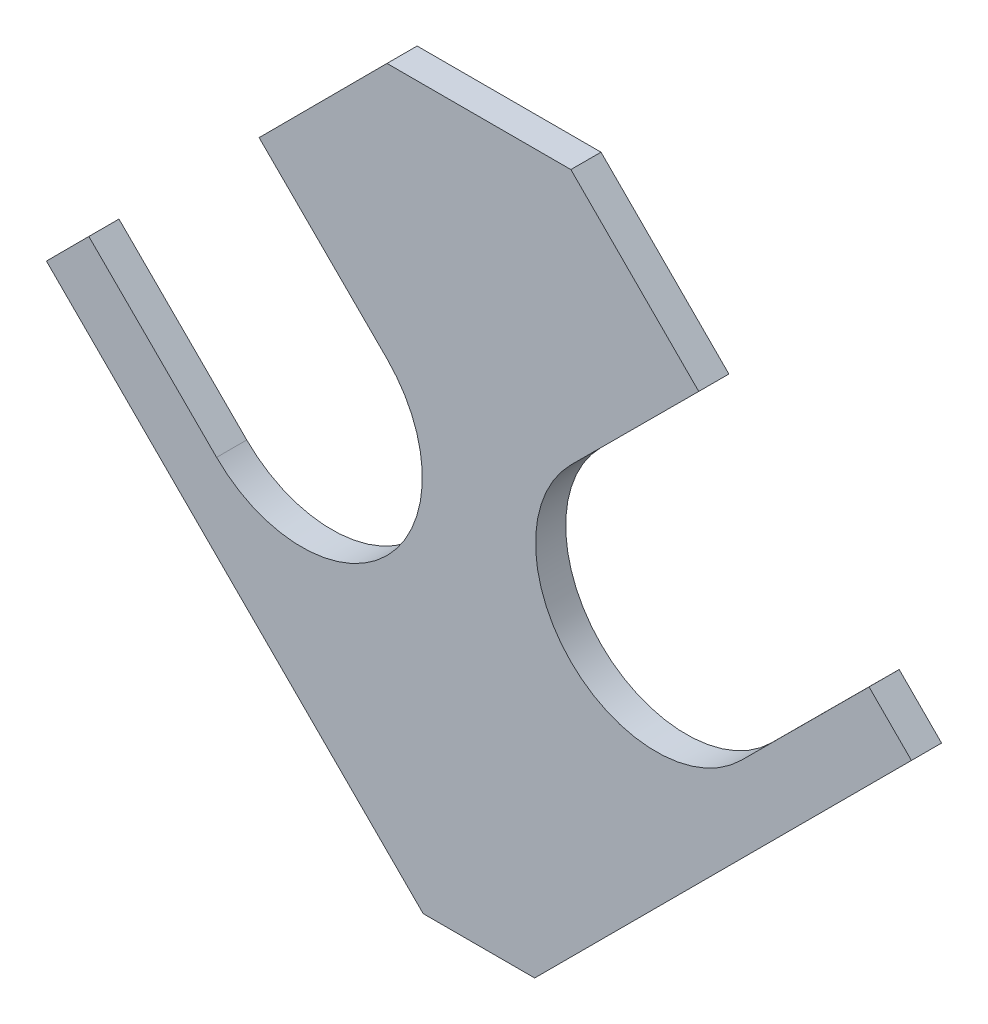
ISO-10303-21;
HEADER;
FILE_DESCRIPTION(('STEP AP214'),'2;1');
FILE_NAME('part.step','',(''),(''),'','','');
FILE_SCHEMA(('AUTOMOTIVE_DESIGN { 1 0 10303 214 1 1 1 1 }'));
ENDSEC;
DATA;
#1=APPLICATION_CONTEXT('core data for automotive mechanical design processes');
#2=APPLICATION_PROTOCOL_DEFINITION('international standard','automotive_design',2000,#1);
#3=PRODUCT_CONTEXT('',#1,'mechanical');
#4=PRODUCT('Part','Part','',(#3));
#5=PRODUCT_RELATED_PRODUCT_CATEGORY('part','',(#4));
#6=PRODUCT_DEFINITION_FORMATION('','',#4);
#7=PRODUCT_DEFINITION_CONTEXT('part definition',#1,'design');
#8=PRODUCT_DEFINITION('design','',#6,#7);
#9=PRODUCT_DEFINITION_SHAPE('','',#8);
#10=(LENGTH_UNIT() NAMED_UNIT(*) SI_UNIT(.MILLI.,.METRE.));
#11=(NAMED_UNIT(*) PLANE_ANGLE_UNIT() SI_UNIT($,.RADIAN.));
#12=(NAMED_UNIT(*) SI_UNIT($,.STERADIAN.) SOLID_ANGLE_UNIT());
#13=UNCERTAINTY_MEASURE_WITH_UNIT(LENGTH_MEASURE(1.E-05),#10,'distance_accuracy_value','');
#14=(GEOMETRIC_REPRESENTATION_CONTEXT(3) GLOBAL_UNCERTAINTY_ASSIGNED_CONTEXT((#13)) GLOBAL_UNIT_ASSIGNED_CONTEXT((#10,
#11,#12)) REPRESENTATION_CONTEXT('',''));
#15=CARTESIAN_POINT('',(0.,0.,0.));
#16=DIRECTION('',(0.,0.,1.));
#17=DIRECTION('',(1.,0.,0.));
#18=AXIS2_PLACEMENT_3D('',#15,#16,#17);
#19=CARTESIAN_POINT('',(-182.235378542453,182.235378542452,12.7));
#20=DIRECTION('',(0.708026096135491,-0.706186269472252,0.));
#21=DIRECTION('',(0.706186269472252,0.708026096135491,0.));
#22=AXIS2_PLACEMENT_3D('',#19,#20,#21);
#23=PLANE('',#22);
#24=DIRECTION('',(-0.706186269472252,-0.708026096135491,0.));
#25=VECTOR('',#24,1.);
#26=CARTESIAN_POINT('',(-182.235378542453,182.235378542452,0.));
#27=LINE('',#26,#25);
#28=CARTESIAN_POINT('',(-38.7382071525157,326.106403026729,0.));
#29=VERTEX_POINT('',#28);
#30=CARTESIAN_POINT('',(-92.6195311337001,272.084702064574,0.));
#31=VERTEX_POINT('',#30);
#32=EDGE_CURVE('E146',#29,#31,#27,.T.);
#33=ORIENTED_EDGE('',*,*,#32,.T.);
#34=DIRECTION('',(0.,0.,1.));
#35=VECTOR('',#34,1.);
#36=CARTESIAN_POINT('',(-92.6195311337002,272.084702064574,-0.000999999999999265));
#37=LINE('',#36,#35);
#38=CARTESIAN_POINT('',(-92.6195311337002,272.084702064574,12.7));
#39=VERTEX_POINT('',#38);
#40=EDGE_CURVE('E130',#31,#39,#37,.T.);
#41=ORIENTED_EDGE('',*,*,#40,.T.);
#42=DIRECTION('',(-0.706186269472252,-0.708026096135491,0.));
#43=VECTOR('',#42,1.);
#44=CARTESIAN_POINT('',(-182.235378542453,182.235378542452,12.7));
#45=LINE('',#44,#43);
#46=CARTESIAN_POINT('',(-38.7382071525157,326.106403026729,12.7));
#47=VERTEX_POINT('',#46);
#48=EDGE_CURVE('E167',#47,#39,#45,.T.);
#49=ORIENTED_EDGE('',*,*,#48,.F.);
#50=DIRECTION('',(0.,0.,-1.));
#51=VECTOR('',#50,1.);
#52=CARTESIAN_POINT('',(-38.7382071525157,326.106403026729,12.7));
#53=LINE('',#52,#51);
#54=EDGE_CURVE('E153',#47,#29,#53,.T.);
#55=ORIENTED_EDGE('',*,*,#54,.T.);
#56=EDGE_LOOP('',(#33,#41,#49,#55));
#57=FACE_BOUND('',#56,.T.);
#58=ADVANCED_FACE('F31',(#57),#23,.F.);
#59=CARTESIAN_POINT('',(-74.6592316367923,182.422305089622,12.7));
#60=DIRECTION('',(0.,0.,-1.));
#61=DIRECTION('',(-1.,0.,0.));
#62=AXIS2_PLACEMENT_3D('',#59,#60,#61);
#63=CYLINDRICAL_SURFACE('',#62,50.8);
#64=CARTESIAN_POINT('',(-74.6592316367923,182.422305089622,12.7));
#65=DIRECTION('',(0.,0.,1.));
#66=DIRECTION('',(1.,0.,0.));
#67=AXIS2_PLACEMENT_3D('',#64,#65,#66);
#68=CIRCLE('',#67,50.8);
#69=CARTESIAN_POINT('',(-110.533494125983,146.454579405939,12.7));
#70=VERTEX_POINT('',#69);
#71=CARTESIAN_POINT('',(-38.7849691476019,218.390030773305,12.7));
#72=VERTEX_POINT('',#71);
#73=EDGE_CURVE('E232',#70,#72,#68,.T.);
#74=ORIENTED_EDGE('',*,*,#73,.T.);
#75=DIRECTION('',(0.,0.,1.));
#76=VECTOR('',#75,1.);
#77=CARTESIAN_POINT('',(-38.7849691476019,218.390030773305,-0.000999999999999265));
#78=LINE('',#77,#76);
#79=CARTESIAN_POINT('',(-38.7849691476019,218.390030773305,0.));
#80=VERTEX_POINT('',#79);
#81=EDGE_CURVE('E139',#80,#72,#78,.T.);
#82=ORIENTED_EDGE('',*,*,#81,.F.);
#83=CARTESIAN_POINT('',(-74.6592316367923,182.422305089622,0.));
#84=DIRECTION('',(0.,0.,1.));
#85=DIRECTION('',(1.,0.,0.));
#86=AXIS2_PLACEMENT_3D('',#83,#84,#85);
#87=CIRCLE('',#86,50.8);
#88=CARTESIAN_POINT('',(-110.533494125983,146.454579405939,0.));
#89=VERTEX_POINT('',#88);
#90=EDGE_CURVE('E149',#89,#80,#87,.T.);
#91=ORIENTED_EDGE('',*,*,#90,.F.);
#92=DIRECTION('',(0.,0.,1.));
#93=VECTOR('',#92,1.);
#94=CARTESIAN_POINT('',(-110.533494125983,146.454579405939,-0.000999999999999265));
#95=LINE('',#94,#93);
#96=EDGE_CURVE('E255',#89,#70,#95,.T.);
#97=ORIENTED_EDGE('',*,*,#96,.T.);
#98=EDGE_LOOP('',(#74,#82,#91,#97));
#99=FACE_BOUND('',#98,.T.);
#100=ADVANCED_FACE('F286',(#99),#63,.F.);
#101=CARTESIAN_POINT('',(182.235378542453,182.235378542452,12.7));
#102=DIRECTION('',(-0.70802609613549,-0.706186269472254,0.));
#103=DIRECTION('',(0.706186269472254,-0.70802609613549,0.));
#104=AXIS2_PLACEMENT_3D('',#101,#102,#103);
#105=PLANE('',#104);
#106=DIRECTION('',(-0.706186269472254,0.70802609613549,0.));
#107=VECTOR('',#106,1.);
#108=CARTESIAN_POINT('',(182.235378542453,182.235378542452,12.7));
#109=LINE('',#108,#107);
#110=CARTESIAN_POINT('',(92.6195311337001,272.084702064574,12.7));
#111=VERTEX_POINT('',#110);
#112=CARTESIAN_POINT('',(38.7382071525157,326.106403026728,12.7));
#113=VERTEX_POINT('',#112);
#114=EDGE_CURVE('E211',#111,#113,#109,.T.);
#115=ORIENTED_EDGE('',*,*,#114,.F.);
#116=DIRECTION('',(0.,0.,1.));
#117=VECTOR('',#116,1.);
#118=CARTESIAN_POINT('',(92.6195311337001,272.084702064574,-0.000999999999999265));
#119=LINE('',#118,#117);
#120=CARTESIAN_POINT('',(92.6195311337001,272.084702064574,0.));
#121=VERTEX_POINT('',#120);
#122=EDGE_CURVE('E210',#121,#111,#119,.T.);
#123=ORIENTED_EDGE('',*,*,#122,.F.);
#124=DIRECTION('',(-0.706186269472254,0.70802609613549,0.));
#125=VECTOR('',#124,1.);
#126=CARTESIAN_POINT('',(182.235378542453,182.235378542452,0.));
#127=LINE('',#126,#125);
#128=CARTESIAN_POINT('',(38.7382071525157,326.106403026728,0.));
#129=VERTEX_POINT('',#128);
#130=EDGE_CURVE('E190',#121,#129,#127,.T.);
#131=ORIENTED_EDGE('',*,*,#130,.T.);
#132=DIRECTION('',(0.,0.,-1.));
#133=VECTOR('',#132,1.);
#134=CARTESIAN_POINT('',(38.7382071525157,326.106403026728,12.7));
#135=LINE('',#134,#133);
#136=EDGE_CURVE('E169',#113,#129,#135,.T.);
#137=ORIENTED_EDGE('',*,*,#136,.F.);
#138=EDGE_LOOP('',(#115,#123,#131,#137));
#139=FACE_BOUND('',#138,.T.);
#140=ADVANCED_FACE('F209',(#139),#105,.F.);
#141=CARTESIAN_POINT('',(2.53269627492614E-13,-2.53269627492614E-13,12.7));
#142=DIRECTION('',(0.,0.,-1.));
#143=DIRECTION('',(-1.,0.,0.));
#144=AXIS2_PLACEMENT_3D('',#141,#142,#143);
#145=PLANE('',#144);
#146=ORIENTED_EDGE('',*,*,#48,.T.);
#147=DIRECTION('',(-0.708026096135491,0.706186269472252,0.));
#148=VECTOR('',#147,1.);
#149=CARTESIAN_POINT('',(-38.7849691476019,218.390030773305,12.7));
#150=LINE('',#149,#148);
#151=EDGE_CURVE('E133',#72,#39,#150,.T.);
#152=ORIENTED_EDGE('',*,*,#151,.F.);
#153=ORIENTED_EDGE('',*,*,#73,.F.);
#154=DIRECTION('',(0.708026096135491,-0.706186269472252,0.));
#155=VECTOR('',#154,1.);
#156=CARTESIAN_POINT('',(-110.533494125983,146.454579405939,12.7));
#157=LINE('',#156,#155);
#158=CARTESIAN_POINT('',(-164.368056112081,200.149250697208,12.7));
#159=VERTEX_POINT('',#158);
#160=EDGE_CURVE('E54',#159,#70,#157,.T.);
#161=ORIENTED_EDGE('',*,*,#160,.F.);
#162=CARTESIAN_POINT('',(-182.235378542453,182.235378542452,12.7));
#163=VERTEX_POINT('',#162);
#164=EDGE_CURVE('E243',#159,#163,#45,.T.);
#165=ORIENTED_EDGE('',*,*,#164,.T.);
#166=DIRECTION('',(0.707106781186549,-0.707106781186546,0.));
#167=VECTOR('',#166,1.);
#168=CARTESIAN_POINT('',(-23.4853785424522,23.4853785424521,12.7));
#169=LINE('',#168,#167);
#170=CARTESIAN_POINT('',(-23.4853785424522,23.4853785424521,12.7));
#171=VERTEX_POINT('',#170);
#172=EDGE_CURVE('E154',#163,#171,#169,.T.);
#173=ORIENTED_EDGE('',*,*,#172,.T.);
#174=DIRECTION('',(1.,0.,0.));
#175=VECTOR('',#174,1.);
#176=CARTESIAN_POINT('',(-23.4853785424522,23.4853785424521,12.7));
#177=LINE('',#176,#175);
#178=CARTESIAN_POINT('',(23.4853785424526,23.485378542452,12.7));
#179=VERTEX_POINT('',#178);
#180=EDGE_CURVE('E158',#171,#179,#177,.T.);
#181=ORIENTED_EDGE('',*,*,#180,.T.);
#182=DIRECTION('',(0.707106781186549,0.707106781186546,0.));
#183=VECTOR('',#182,1.);
#184=CARTESIAN_POINT('',(23.4853785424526,23.485378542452,12.7));
#185=LINE('',#184,#183);
#186=CARTESIAN_POINT('',(182.235378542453,182.235378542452,12.7));
#187=VERTEX_POINT('',#186);
#188=EDGE_CURVE('E182',#179,#187,#185,.T.);
#189=ORIENTED_EDGE('',*,*,#188,.T.);
#190=CARTESIAN_POINT('',(164.368056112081,200.149250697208,12.7));
#191=VERTEX_POINT('',#190);
#192=EDGE_CURVE('E238',#187,#191,#109,.T.);
#193=ORIENTED_EDGE('',*,*,#192,.T.);
#194=DIRECTION('',(0.70802609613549,0.706186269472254,0.));
#195=VECTOR('',#194,1.);
#196=CARTESIAN_POINT('',(164.368056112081,200.149250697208,12.7));
#197=LINE('',#196,#195);
#198=CARTESIAN_POINT('',(110.533494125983,146.454579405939,12.7));
#199=VERTEX_POINT('',#198);
#200=EDGE_CURVE('E263',#199,#191,#197,.T.);
#201=ORIENTED_EDGE('',*,*,#200,.F.);
#202=CARTESIAN_POINT('',(74.6592316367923,182.422305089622,12.7));
#203=DIRECTION('',(0.,0.,1.));
#204=DIRECTION('',(1.,0.,0.));
#205=AXIS2_PLACEMENT_3D('',#202,#203,#204);
#206=CIRCLE('',#205,50.8);
#207=CARTESIAN_POINT('',(38.7849691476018,218.390030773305,12.7));
#208=VERTEX_POINT('',#207);
#209=EDGE_CURVE('E228',#208,#199,#206,.T.);
#210=ORIENTED_EDGE('',*,*,#209,.F.);
#211=DIRECTION('',(-0.70802609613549,-0.706186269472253,0.));
#212=VECTOR('',#211,1.);
#213=CARTESIAN_POINT('',(38.7849691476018,218.390030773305,12.7));
#214=LINE('',#213,#212);
#215=EDGE_CURVE('E225',#111,#208,#214,.T.);
#216=ORIENTED_EDGE('',*,*,#215,.F.);
#217=ORIENTED_EDGE('',*,*,#114,.T.);
#218=DIRECTION('',(-1.,0.,0.));
#219=VECTOR('',#218,1.);
#220=CARTESIAN_POINT('',(-38.7382071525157,326.106403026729,12.7));
#221=LINE('',#220,#219);
#222=EDGE_CURVE('E241',#113,#47,#221,.T.);
#223=ORIENTED_EDGE('',*,*,#222,.T.);
#224=EDGE_LOOP('',(#146,#152,#153,#161,#165,#173,#181,#189,#193,#201,#210,#216,#217,#223));
#225=FACE_BOUND('',#224,.T.);
#226=ADVANCED_FACE('F271',(#225),#145,.F.);
#227=CARTESIAN_POINT('',(2.53269627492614E-13,-2.53269627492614E-13,0.));
#228=DIRECTION('',(0.,0.,-1.));
#229=DIRECTION('',(-1.,0.,0.));
#230=AXIS2_PLACEMENT_3D('',#227,#228,#229);
#231=PLANE('',#230);
#232=DIRECTION('',(-0.708026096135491,0.706186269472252,0.));
#233=VECTOR('',#232,1.);
#234=CARTESIAN_POINT('',(-38.7849691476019,218.390030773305,0.));
#235=LINE('',#234,#233);
#236=EDGE_CURVE('E46',#80,#31,#235,.T.);
#237=ORIENTED_EDGE('',*,*,#236,.T.);
#238=ORIENTED_EDGE('',*,*,#32,.F.);
#239=DIRECTION('',(-1.,0.,0.));
#240=VECTOR('',#239,1.);
#241=CARTESIAN_POINT('',(-38.7382071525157,326.106403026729,0.));
#242=LINE('',#241,#240);
#243=EDGE_CURVE('E160',#129,#29,#242,.T.);
#244=ORIENTED_EDGE('',*,*,#243,.F.);
#245=ORIENTED_EDGE('',*,*,#130,.F.);
#246=DIRECTION('',(-0.70802609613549,-0.706186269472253,0.));
#247=VECTOR('',#246,1.);
#248=CARTESIAN_POINT('',(38.7849691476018,218.390030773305,0.));
#249=LINE('',#248,#247);
#250=CARTESIAN_POINT('',(38.7849691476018,218.390030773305,0.));
#251=VERTEX_POINT('',#250);
#252=EDGE_CURVE('E204',#121,#251,#249,.T.);
#253=ORIENTED_EDGE('',*,*,#252,.T.);
#254=CARTESIAN_POINT('',(74.6592316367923,182.422305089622,0.));
#255=DIRECTION('',(0.,0.,1.));
#256=DIRECTION('',(1.,0.,0.));
#257=AXIS2_PLACEMENT_3D('',#254,#255,#256);
#258=CIRCLE('',#257,50.8);
#259=CARTESIAN_POINT('',(110.533494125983,146.454579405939,0.));
#260=VERTEX_POINT('',#259);
#261=EDGE_CURVE('E227',#251,#260,#258,.T.);
#262=ORIENTED_EDGE('',*,*,#261,.T.);
#263=DIRECTION('',(0.70802609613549,0.706186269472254,0.));
#264=VECTOR('',#263,1.);
#265=CARTESIAN_POINT('',(164.368056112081,200.149250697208,0.));
#266=LINE('',#265,#264);
#267=CARTESIAN_POINT('',(164.368056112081,200.149250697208,0.));
#268=VERTEX_POINT('',#267);
#269=EDGE_CURVE('E218',#260,#268,#266,.T.);
#270=ORIENTED_EDGE('',*,*,#269,.T.);
#271=CARTESIAN_POINT('',(182.235378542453,182.235378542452,0.));
#272=VERTEX_POINT('',#271);
#273=EDGE_CURVE('E189',#272,#268,#127,.T.);
#274=ORIENTED_EDGE('',*,*,#273,.F.);
#275=DIRECTION('',(0.707106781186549,0.707106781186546,0.));
#276=VECTOR('',#275,1.);
#277=CARTESIAN_POINT('',(23.4853785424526,23.485378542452,0.));
#278=LINE('',#277,#276);
#279=CARTESIAN_POINT('',(23.4853785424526,23.485378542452,0.));
#280=VERTEX_POINT('',#279);
#281=EDGE_CURVE('E181',#280,#272,#278,.T.);
#282=ORIENTED_EDGE('',*,*,#281,.F.);
#283=DIRECTION('',(1.,0.,0.));
#284=VECTOR('',#283,1.);
#285=CARTESIAN_POINT('',(-23.4853785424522,23.4853785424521,0.));
#286=LINE('',#285,#284);
#287=CARTESIAN_POINT('',(-23.4853785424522,23.4853785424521,0.));
#288=VERTEX_POINT('',#287);
#289=EDGE_CURVE('E186',#288,#280,#286,.T.);
#290=ORIENTED_EDGE('',*,*,#289,.F.);
#291=DIRECTION('',(0.707106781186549,-0.707106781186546,0.));
#292=VECTOR('',#291,1.);
#293=CARTESIAN_POINT('',(-23.4853785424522,23.4853785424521,0.));
#294=LINE('',#293,#292);
#295=CARTESIAN_POINT('',(-182.235378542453,182.235378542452,0.));
#296=VERTEX_POINT('',#295);
#297=EDGE_CURVE('E192',#296,#288,#294,.T.);
#298=ORIENTED_EDGE('',*,*,#297,.F.);
#299=CARTESIAN_POINT('',(-164.368056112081,200.149250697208,0.));
#300=VERTEX_POINT('',#299);
#301=EDGE_CURVE('E155',#300,#296,#27,.T.);
#302=ORIENTED_EDGE('',*,*,#301,.F.);
#303=DIRECTION('',(0.708026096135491,-0.706186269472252,0.));
#304=VECTOR('',#303,1.);
#305=CARTESIAN_POINT('',(-110.533494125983,146.454579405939,0.));
#306=LINE('',#305,#304);
#307=EDGE_CURVE('E138',#300,#89,#306,.T.);
#308=ORIENTED_EDGE('',*,*,#307,.T.);
#309=ORIENTED_EDGE('',*,*,#90,.T.);
#310=EDGE_LOOP('',(#237,#238,#244,#245,#253,#262,#270,#274,#282,#290,#298,#302,#308,#309));
#311=FACE_BOUND('',#310,.T.);
#312=ADVANCED_FACE('F144',(#311),#231,.T.);
#313=CARTESIAN_POINT('',(-23.4853785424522,23.4853785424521,12.7));
#314=DIRECTION('',(0.707106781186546,0.707106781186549,0.));
#315=DIRECTION('',(-0.707106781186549,0.707106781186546,0.));
#316=AXIS2_PLACEMENT_3D('',#313,#314,#315);
#317=PLANE('',#316);
#318=ORIENTED_EDGE('',*,*,#297,.T.);
#319=DIRECTION('',(0.,0.,-1.));
#320=VECTOR('',#319,1.);
#321=CARTESIAN_POINT('',(-23.4853785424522,23.4853785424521,12.7));
#322=LINE('',#321,#320);
#323=EDGE_CURVE('E11',#171,#288,#322,.T.);
#324=ORIENTED_EDGE('',*,*,#323,.F.);
#325=ORIENTED_EDGE('',*,*,#172,.F.);
#326=DIRECTION('',(0.,0.,-1.));
#327=VECTOR('',#326,1.);
#328=CARTESIAN_POINT('',(-182.235378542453,182.235378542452,12.7));
#329=LINE('',#328,#327);
#330=EDGE_CURVE('E164',#163,#296,#329,.T.);
#331=ORIENTED_EDGE('',*,*,#330,.T.);
#332=EDGE_LOOP('',(#318,#324,#325,#331));
#333=FACE_BOUND('',#332,.T.);
#334=ADVANCED_FACE('F33',(#333),#317,.F.);
#335=CARTESIAN_POINT('',(-23.4853785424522,23.4853785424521,12.7));
#336=DIRECTION('',(0.,1.,0.));
#337=DIRECTION('',(-1.,0.,0.));
#338=AXIS2_PLACEMENT_3D('',#335,#336,#337);
#339=PLANE('',#338);
#340=ORIENTED_EDGE('',*,*,#289,.T.);
#341=DIRECTION('',(0.,0.,-1.));
#342=VECTOR('',#341,1.);
#343=CARTESIAN_POINT('',(23.4853785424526,23.485378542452,12.7));
#344=LINE('',#343,#342);
#345=EDGE_CURVE('E39',#179,#280,#344,.T.);
#346=ORIENTED_EDGE('',*,*,#345,.F.);
#347=ORIENTED_EDGE('',*,*,#180,.F.);
#348=ORIENTED_EDGE('',*,*,#323,.T.);
#349=EDGE_LOOP('',(#340,#346,#347,#348));
#350=FACE_BOUND('',#349,.T.);
#351=ADVANCED_FACE('F283',(#350),#339,.F.);
#352=CARTESIAN_POINT('',(23.4853785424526,23.485378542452,12.7));
#353=DIRECTION('',(-0.707106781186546,0.707106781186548,0.));
#354=DIRECTION('',(-0.707106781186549,-0.707106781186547,0.));
#355=AXIS2_PLACEMENT_3D('',#352,#353,#354);
#356=PLANE('',#355);
#357=ORIENTED_EDGE('',*,*,#281,.T.);
#358=DIRECTION('',(0.,0.,-1.));
#359=VECTOR('',#358,1.);
#360=CARTESIAN_POINT('',(182.235378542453,182.235378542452,12.7));
#361=LINE('',#360,#359);
#362=EDGE_CURVE('E172',#187,#272,#361,.T.);
#363=ORIENTED_EDGE('',*,*,#362,.F.);
#364=ORIENTED_EDGE('',*,*,#188,.F.);
#365=ORIENTED_EDGE('',*,*,#345,.T.);
#366=EDGE_LOOP('',(#357,#363,#364,#365));
#367=FACE_BOUND('',#366,.T.);
#368=ADVANCED_FACE('F179',(#367),#356,.F.);
#369=ORIENTED_EDGE('',*,*,#273,.T.);
#370=DIRECTION('',(0.,0.,1.));
#371=VECTOR('',#370,1.);
#372=CARTESIAN_POINT('',(164.368056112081,200.149250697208,-0.000999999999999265));
#373=LINE('',#372,#371);
#374=EDGE_CURVE('E215',#268,#191,#373,.T.);
#375=ORIENTED_EDGE('',*,*,#374,.T.);
#376=ORIENTED_EDGE('',*,*,#192,.F.);
#377=ORIENTED_EDGE('',*,*,#362,.T.);
#378=EDGE_LOOP('',(#369,#375,#376,#377));
#379=FACE_BOUND('',#378,.T.);
#380=ADVANCED_FACE('F275',(#379),#105,.F.);
#381=CARTESIAN_POINT('',(-38.7382071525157,326.106403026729,12.7));
#382=DIRECTION('',(0.,-1.,0.));
#383=DIRECTION('',(1.,0.,0.));
#384=AXIS2_PLACEMENT_3D('',#381,#382,#383);
#385=PLANE('',#384);
#386=ORIENTED_EDGE('',*,*,#243,.T.);
#387=ORIENTED_EDGE('',*,*,#54,.F.);
#388=ORIENTED_EDGE('',*,*,#222,.F.);
#389=ORIENTED_EDGE('',*,*,#136,.T.);
#390=EDGE_LOOP('',(#386,#387,#388,#389));
#391=FACE_BOUND('',#390,.T.);
#392=ADVANCED_FACE('F198',(#391),#385,.F.);
#393=ORIENTED_EDGE('',*,*,#164,.F.);
#394=DIRECTION('',(0.,0.,1.));
#395=VECTOR('',#394,1.);
#396=CARTESIAN_POINT('',(-164.368056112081,200.149250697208,-0.000999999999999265));
#397=LINE('',#396,#395);
#398=EDGE_CURVE('E254',#300,#159,#397,.T.);
#399=ORIENTED_EDGE('',*,*,#398,.F.);
#400=ORIENTED_EDGE('',*,*,#301,.T.);
#401=ORIENTED_EDGE('',*,*,#330,.F.);
#402=EDGE_LOOP('',(#393,#399,#400,#401));
#403=FACE_BOUND('',#402,.T.);
#404=ADVANCED_FACE('F253',(#403),#23,.F.);
#405=CARTESIAN_POINT('',(74.6592316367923,182.422305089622,12.7));
#406=DIRECTION('',(0.,0.,-1.));
#407=DIRECTION('',(-1.,0.,0.));
#408=AXIS2_PLACEMENT_3D('',#405,#406,#407);
#409=CYLINDRICAL_SURFACE('',#408,50.8);
#410=DIRECTION('',(0.,0.,1.));
#411=VECTOR('',#410,1.);
#412=CARTESIAN_POINT('',(38.7849691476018,218.390030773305,-0.000999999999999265));
#413=LINE('',#412,#411);
#414=EDGE_CURVE('E214',#251,#208,#413,.T.);
#415=ORIENTED_EDGE('',*,*,#414,.T.);
#416=ORIENTED_EDGE('',*,*,#209,.T.);
#417=DIRECTION('',(0.,0.,1.));
#418=VECTOR('',#417,1.);
#419=CARTESIAN_POINT('',(110.533494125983,146.454579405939,-0.000999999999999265));
#420=LINE('',#419,#418);
#421=EDGE_CURVE('E220',#260,#199,#420,.T.);
#422=ORIENTED_EDGE('',*,*,#421,.F.);
#423=ORIENTED_EDGE('',*,*,#261,.F.);
#424=EDGE_LOOP('',(#415,#416,#422,#423));
#425=FACE_BOUND('',#424,.T.);
#426=ADVANCED_FACE('F268',(#425),#409,.F.);
#427=CARTESIAN_POINT('',(164.368056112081,200.149250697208,-0.000999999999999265));
#428=DIRECTION('',(0.706186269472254,-0.70802609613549,0.));
#429=DIRECTION('',(0.70802609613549,0.706186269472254,0.));
#430=AXIS2_PLACEMENT_3D('',#427,#428,#429);
#431=PLANE('',#430);
#432=ORIENTED_EDGE('',*,*,#421,.T.);
#433=ORIENTED_EDGE('',*,*,#200,.T.);
#434=ORIENTED_EDGE('',*,*,#374,.F.);
#435=ORIENTED_EDGE('',*,*,#269,.F.);
#436=EDGE_LOOP('',(#432,#433,#434,#435));
#437=FACE_BOUND('',#436,.T.);
#438=ADVANCED_FACE('F274',(#437),#431,.F.);
#439=CARTESIAN_POINT('',(38.7849691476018,218.390030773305,-0.000999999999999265));
#440=DIRECTION('',(-0.706186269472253,0.70802609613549,0.));
#441=DIRECTION('',(-0.70802609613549,-0.706186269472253,0.));
#442=AXIS2_PLACEMENT_3D('',#439,#440,#441);
#443=PLANE('',#442);
#444=ORIENTED_EDGE('',*,*,#122,.T.);
#445=ORIENTED_EDGE('',*,*,#215,.T.);
#446=ORIENTED_EDGE('',*,*,#414,.F.);
#447=ORIENTED_EDGE('',*,*,#252,.F.);
#448=EDGE_LOOP('',(#444,#445,#446,#447));
#449=FACE_BOUND('',#448,.T.);
#450=ADVANCED_FACE('F264',(#449),#443,.F.);
#451=CARTESIAN_POINT('',(-110.533494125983,146.454579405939,-0.000999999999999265));
#452=DIRECTION('',(-0.706186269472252,-0.708026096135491,0.));
#453=DIRECTION('',(0.708026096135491,-0.706186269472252,0.));
#454=AXIS2_PLACEMENT_3D('',#451,#452,#453);
#455=PLANE('',#454);
#456=ORIENTED_EDGE('',*,*,#398,.T.);
#457=ORIENTED_EDGE('',*,*,#160,.T.);
#458=ORIENTED_EDGE('',*,*,#96,.F.);
#459=ORIENTED_EDGE('',*,*,#307,.F.);
#460=EDGE_LOOP('',(#456,#457,#458,#459));
#461=FACE_BOUND('',#460,.T.);
#462=ADVANCED_FACE('F318',(#461),#455,.F.);
#463=CARTESIAN_POINT('',(-38.7849691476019,218.390030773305,-0.000999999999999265));
#464=DIRECTION('',(0.706186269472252,0.708026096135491,0.));
#465=DIRECTION('',(-0.708026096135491,0.706186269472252,0.));
#466=AXIS2_PLACEMENT_3D('',#463,#464,#465);
#467=PLANE('',#466);
#468=ORIENTED_EDGE('',*,*,#81,.T.);
#469=ORIENTED_EDGE('',*,*,#151,.T.);
#470=ORIENTED_EDGE('',*,*,#40,.F.);
#471=ORIENTED_EDGE('',*,*,#236,.F.);
#472=EDGE_LOOP('',(#468,#469,#470,#471));
#473=FACE_BOUND('',#472,.T.);
#474=ADVANCED_FACE('F131',(#473),#467,.F.);
#475=CLOSED_SHELL('',(#58,#100,#140,#226,#312,#334,#351,#368,#380,#392,#404,#426,#438,#450,#462,#474));
#476=MANIFOLD_SOLID_BREP('B2',#475);
#477=ADVANCED_BREP_SHAPE_REPRESENTATION('',(#18,#476),#14);
#478=SHAPE_DEFINITION_REPRESENTATION(#9,#477);
ENDSEC;
END-ISO-10303-21;
